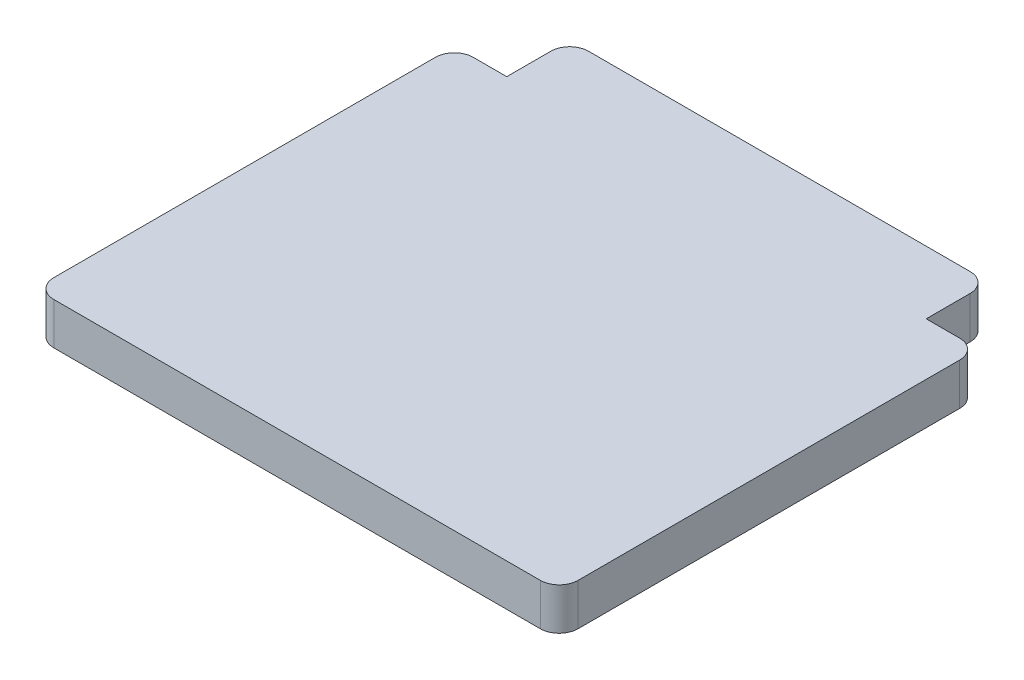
from build123d import *

# Parameters (mm, degrees)
ESBO_O1_W                = 20
ESBO_O1_H                = 3
RESSALTO_EXTRUS_O1_DEPTH = 2


with BuildPart() as part:
    # Esbo_o1 → Ressalto-extrus_o1 (new body)
    with BuildSketch(Plane(origin=(0, 0, 0), x_dir=(1, 0, 0), z_dir=(0, 1, 0))):
        with BuildLine():
            Line((-10, 10), (-11.599758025, 10))
            ThreePointArc((-11.599758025, 10), (-12.23632523, 9.73632523), (-12.5, 9.099758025))
            Line((-12.5, 9.099758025), (-12.5, -9.099758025))
            ThreePointArc((-12.5, -9.099758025), (-12.23632523, -9.73632523), (-11.599758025, -10))
            Line((-11.599758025, -10), (11.599758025, -10))
            ThreePointArc((11.599758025, -10), (12.23632523, -9.73632523), (12.5, -9.099758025))
            Line((12.5, -9.099758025), (12.5, 9.099758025))
            ThreePointArc((12.5, 9.099758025), (12.23632523, 9.73632523), (11.599758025, 10))
            Line((11.599758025, 10), (10, 10))
            Line((10, 10), (10, 7))
            Line((10, 7), (-10, 7))
            Line((-10, 7), (-10, 10))
        make_face()
        with BuildLine():
            Line((-10, 12.099758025), (-10, 10))
            Line((-10, 10), (10, 10))
            Line((10, 10), (10, 12.099758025))
            ThreePointArc((10, 12.099758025), (9.73632523, 12.73632523), (9.099758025, 13))
            Line((9.099758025, 13), (-9.099758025, 13))
            ThreePointArc((-9.099758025, 13), (-9.73632523, 12.73632523), (-10, 12.099758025))
        make_face()
        with Locations((0, 8.5)):
            Rectangle(ESBO_O1_W, ESBO_O1_H)
    extrude(amount=RESSALTO_EXTRUS_O1_DEPTH)


solid = part.part
